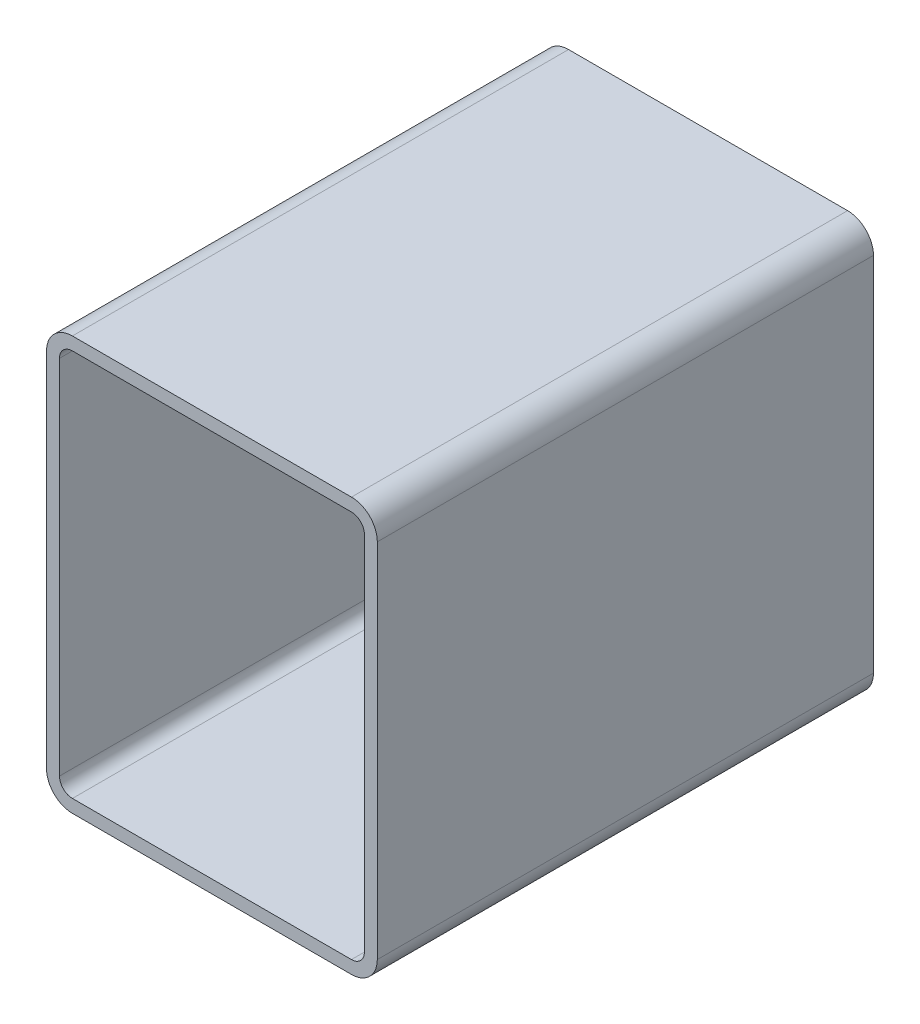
ISO-10303-21;
HEADER;
FILE_DESCRIPTION(('STEP AP214'),'2;1');
FILE_NAME('part.step','',(''),(''),'','','');
FILE_SCHEMA(('AUTOMOTIVE_DESIGN { 1 0 10303 214 1 1 1 1 }'));
ENDSEC;
DATA;
#1=APPLICATION_CONTEXT('core data for automotive mechanical design processes');
#2=APPLICATION_PROTOCOL_DEFINITION('international standard','automotive_design',2000,#1);
#3=PRODUCT_CONTEXT('',#1,'mechanical');
#4=PRODUCT('Part','Part','',(#3));
#5=PRODUCT_RELATED_PRODUCT_CATEGORY('part','',(#4));
#6=PRODUCT_DEFINITION_FORMATION('','',#4);
#7=PRODUCT_DEFINITION_CONTEXT('part definition',#1,'design');
#8=PRODUCT_DEFINITION('design','',#6,#7);
#9=PRODUCT_DEFINITION_SHAPE('','',#8);
#10=(LENGTH_UNIT() NAMED_UNIT(*) SI_UNIT(.MILLI.,.METRE.));
#11=(NAMED_UNIT(*) PLANE_ANGLE_UNIT() SI_UNIT($,.RADIAN.));
#12=(NAMED_UNIT(*) SI_UNIT($,.STERADIAN.) SOLID_ANGLE_UNIT());
#13=UNCERTAINTY_MEASURE_WITH_UNIT(LENGTH_MEASURE(1.E-05),#10,'distance_accuracy_value','');
#14=(GEOMETRIC_REPRESENTATION_CONTEXT(3) GLOBAL_UNCERTAINTY_ASSIGNED_CONTEXT((#13)) GLOBAL_UNIT_ASSIGNED_CONTEXT((#10,
#11,#12)) REPRESENTATION_CONTEXT('',''));
#15=CARTESIAN_POINT('',(0.,0.,0.));
#16=DIRECTION('',(0.,0.,1.));
#17=DIRECTION('',(1.,0.,0.));
#18=AXIS2_PLACEMENT_3D('',#15,#16,#17);
#19=CARTESIAN_POINT('',(17.2659404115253,240.045313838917,304.8));
#20=DIRECTION('',(0.,0.,1.));
#21=DIRECTION('',(1.,0.,0.));
#22=AXIS2_PLACEMENT_3D('',#19,#20,#21);
#23=PLANE('',#22);
#24=CARTESIAN_POINT('',(17.2659404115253,240.045313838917,304.8));
#25=DIRECTION('',(0.,0.,1.));
#26=DIRECTION('',(1.,0.,0.));
#27=AXIS2_PLACEMENT_3D('',#24,#25,#26);
#28=CIRCLE('',#27,15.875);
#29=CARTESIAN_POINT('',(17.2659404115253,255.920313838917,304.8));
#30=VERTEX_POINT('',#29);
#31=CARTESIAN_POINT('',(1.3909404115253,240.045313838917,304.8));
#32=VERTEX_POINT('',#31);
#33=EDGE_CURVE('E211',#30,#32,#28,.T.);
#34=ORIENTED_EDGE('',*,*,#33,.T.);
#35=DIRECTION('',(0.,-1.,0.));
#36=VECTOR('',#35,1.);
#37=CARTESIAN_POINT('',(1.3909404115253,17.7953138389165,304.8));
#38=LINE('',#37,#36);
#39=CARTESIAN_POINT('',(1.3909404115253,17.7953138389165,304.8));
#40=VERTEX_POINT('',#39);
#41=EDGE_CURVE('E214',#32,#40,#38,.T.);
#42=ORIENTED_EDGE('',*,*,#41,.T.);
#43=CARTESIAN_POINT('',(17.2659404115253,17.7953138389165,304.8));
#44=DIRECTION('',(0.,0.,1.));
#45=DIRECTION('',(1.,0.,0.));
#46=AXIS2_PLACEMENT_3D('',#43,#44,#45);
#47=CIRCLE('',#46,15.875);
#48=CARTESIAN_POINT('',(17.2659404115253,1.92031383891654,304.8));
#49=VERTEX_POINT('',#48);
#50=EDGE_CURVE('E217',#40,#49,#47,.T.);
#51=ORIENTED_EDGE('',*,*,#50,.T.);
#52=DIRECTION('',(1.,0.,0.));
#53=VECTOR('',#52,1.);
#54=CARTESIAN_POINT('',(188.715940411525,1.92031383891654,304.8));
#55=LINE('',#54,#53);
#56=CARTESIAN_POINT('',(188.715940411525,1.92031383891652,304.8));
#57=VERTEX_POINT('',#56);
#58=EDGE_CURVE('E219',#49,#57,#55,.T.);
#59=ORIENTED_EDGE('',*,*,#58,.T.);
#60=CARTESIAN_POINT('',(188.715940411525,17.7953138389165,304.8));
#61=DIRECTION('',(0.,0.,1.));
#62=DIRECTION('',(1.,0.,0.));
#63=AXIS2_PLACEMENT_3D('',#60,#61,#62);
#64=CIRCLE('',#63,15.875);
#65=CARTESIAN_POINT('',(204.590940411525,17.7953138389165,304.8));
#66=VERTEX_POINT('',#65);
#67=EDGE_CURVE('E221',#57,#66,#64,.T.);
#68=ORIENTED_EDGE('',*,*,#67,.T.);
#69=DIRECTION('',(0.,1.,0.));
#70=VECTOR('',#69,1.);
#71=CARTESIAN_POINT('',(204.590940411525,240.045313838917,304.8));
#72=LINE('',#71,#70);
#73=CARTESIAN_POINT('',(204.590940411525,240.045313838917,304.8));
#74=VERTEX_POINT('',#73);
#75=EDGE_CURVE('E223',#66,#74,#72,.T.);
#76=ORIENTED_EDGE('',*,*,#75,.T.);
#77=CARTESIAN_POINT('',(188.715940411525,240.045313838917,304.8));
#78=DIRECTION('',(0.,0.,1.));
#79=DIRECTION('',(1.,0.,0.));
#80=AXIS2_PLACEMENT_3D('',#77,#78,#79);
#81=CIRCLE('',#80,15.875);
#82=CARTESIAN_POINT('',(188.715940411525,255.920313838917,304.8));
#83=VERTEX_POINT('',#82);
#84=EDGE_CURVE('E225',#74,#83,#81,.T.);
#85=ORIENTED_EDGE('',*,*,#84,.T.);
#86=DIRECTION('',(-1.,0.,0.));
#87=VECTOR('',#86,1.);
#88=CARTESIAN_POINT('',(17.2659404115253,255.920313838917,304.8));
#89=LINE('',#88,#87);
#90=EDGE_CURVE('E227',#83,#30,#89,.T.);
#91=ORIENTED_EDGE('',*,*,#90,.T.);
#92=EDGE_LOOP('',(#34,#42,#51,#59,#68,#76,#85,#91));
#93=FACE_BOUND('',#92,.T.);
#94=DIRECTION('',(0.,-1.,0.));
#95=VECTOR('',#94,1.);
#96=CARTESIAN_POINT('',(9.3284404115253,17.7953138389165,304.8));
#97=LINE('',#96,#95);
#98=CARTESIAN_POINT('',(9.3284404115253,240.045313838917,304.8));
#99=VERTEX_POINT('',#98);
#100=CARTESIAN_POINT('',(9.3284404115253,17.7953138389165,304.8));
#101=VERTEX_POINT('',#100);
#102=EDGE_CURVE('E154',#99,#101,#97,.T.);
#103=ORIENTED_EDGE('',*,*,#102,.F.);
#104=CARTESIAN_POINT('',(17.2659404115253,240.045313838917,304.8));
#105=DIRECTION('',(0.,0.,1.));
#106=DIRECTION('',(1.,0.,0.));
#107=AXIS2_PLACEMENT_3D('',#104,#105,#106);
#108=CIRCLE('',#107,7.9375);
#109=CARTESIAN_POINT('',(17.2659404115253,247.982813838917,304.8));
#110=VERTEX_POINT('',#109);
#111=EDGE_CURVE('E146',#110,#99,#108,.T.);
#112=ORIENTED_EDGE('',*,*,#111,.F.);
#113=DIRECTION('',(-1.,0.,0.));
#114=VECTOR('',#113,1.);
#115=CARTESIAN_POINT('',(17.2659404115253,247.982813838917,304.8));
#116=LINE('',#115,#114);
#117=CARTESIAN_POINT('',(188.715940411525,247.982813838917,304.8));
#118=VERTEX_POINT('',#117);
#119=EDGE_CURVE('E179',#118,#110,#116,.T.);
#120=ORIENTED_EDGE('',*,*,#119,.F.);
#121=CARTESIAN_POINT('',(188.715940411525,240.045313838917,304.8));
#122=DIRECTION('',(0.,0.,1.));
#123=DIRECTION('',(1.,0.,0.));
#124=AXIS2_PLACEMENT_3D('',#121,#122,#123);
#125=CIRCLE('',#124,7.93750000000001);
#126=CARTESIAN_POINT('',(196.653440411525,240.045313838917,304.8));
#127=VERTEX_POINT('',#126);
#128=EDGE_CURVE('E177',#127,#118,#125,.T.);
#129=ORIENTED_EDGE('',*,*,#128,.F.);
#130=DIRECTION('',(0.,1.,0.));
#131=VECTOR('',#130,1.);
#132=CARTESIAN_POINT('',(196.653440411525,240.045313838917,304.8));
#133=LINE('',#132,#131);
#134=CARTESIAN_POINT('',(196.653440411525,17.7953138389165,304.8));
#135=VERTEX_POINT('',#134);
#136=EDGE_CURVE('E175',#135,#127,#133,.T.);
#137=ORIENTED_EDGE('',*,*,#136,.F.);
#138=CARTESIAN_POINT('',(188.715940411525,17.7953138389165,304.8));
#139=DIRECTION('',(0.,0.,1.));
#140=DIRECTION('',(1.,0.,0.));
#141=AXIS2_PLACEMENT_3D('',#138,#139,#140);
#142=CIRCLE('',#141,7.93750000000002);
#143=CARTESIAN_POINT('',(188.715940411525,9.85781383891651,304.8));
#144=VERTEX_POINT('',#143);
#145=EDGE_CURVE('E173',#144,#135,#142,.T.);
#146=ORIENTED_EDGE('',*,*,#145,.F.);
#147=DIRECTION('',(1.,0.,0.));
#148=VECTOR('',#147,1.);
#149=CARTESIAN_POINT('',(188.715940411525,9.85781383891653,304.8));
#150=LINE('',#149,#148);
#151=CARTESIAN_POINT('',(17.2659404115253,9.85781383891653,304.8));
#152=VERTEX_POINT('',#151);
#153=EDGE_CURVE('E169',#152,#144,#150,.T.);
#154=ORIENTED_EDGE('',*,*,#153,.F.);
#155=CARTESIAN_POINT('',(17.2659404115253,17.7953138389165,304.8));
#156=DIRECTION('',(0.,0.,1.));
#157=DIRECTION('',(1.,0.,0.));
#158=AXIS2_PLACEMENT_3D('',#155,#156,#157);
#159=CIRCLE('',#158,7.9375);
#160=EDGE_CURVE('E167',#101,#152,#159,.T.);
#161=ORIENTED_EDGE('',*,*,#160,.F.);
#162=EDGE_LOOP('',(#103,#112,#120,#129,#137,#146,#154,#161));
#163=FACE_BOUND('',#162,.T.);
#164=ADVANCED_FACE('F33',(#93,#163),#23,.T.);
#165=CARTESIAN_POINT('',(17.2659404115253,240.045313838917,0.));
#166=DIRECTION('',(0.,0.,1.));
#167=DIRECTION('',(1.,0.,0.));
#168=AXIS2_PLACEMENT_3D('',#165,#166,#167);
#169=PLANE('',#168);
#170=CARTESIAN_POINT('',(17.2659404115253,240.045313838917,0.));
#171=DIRECTION('',(0.,0.,1.));
#172=DIRECTION('',(1.,0.,0.));
#173=AXIS2_PLACEMENT_3D('',#170,#171,#172);
#174=CIRCLE('',#173,15.875);
#175=CARTESIAN_POINT('',(17.2659404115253,255.920313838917,0.));
#176=VERTEX_POINT('',#175);
#177=CARTESIAN_POINT('',(1.3909404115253,240.045313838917,0.));
#178=VERTEX_POINT('',#177);
#179=EDGE_CURVE('E162',#176,#178,#174,.T.);
#180=ORIENTED_EDGE('',*,*,#179,.F.);
#181=DIRECTION('',(-1.,0.,0.));
#182=VECTOR('',#181,1.);
#183=CARTESIAN_POINT('',(17.2659404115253,255.920313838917,0.));
#184=LINE('',#183,#182);
#185=CARTESIAN_POINT('',(188.715940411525,255.920313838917,0.));
#186=VERTEX_POINT('',#185);
#187=EDGE_CURVE('E215',#186,#176,#184,.T.);
#188=ORIENTED_EDGE('',*,*,#187,.F.);
#189=CARTESIAN_POINT('',(188.715940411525,240.045313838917,0.));
#190=DIRECTION('',(0.,0.,1.));
#191=DIRECTION('',(1.,0.,0.));
#192=AXIS2_PLACEMENT_3D('',#189,#190,#191);
#193=CIRCLE('',#192,15.875);
#194=CARTESIAN_POINT('',(204.590940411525,240.045313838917,0.));
#195=VERTEX_POINT('',#194);
#196=EDGE_CURVE('E242',#195,#186,#193,.T.);
#197=ORIENTED_EDGE('',*,*,#196,.F.);
#198=DIRECTION('',(0.,1.,0.));
#199=VECTOR('',#198,1.);
#200=CARTESIAN_POINT('',(204.590940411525,240.045313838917,0.));
#201=LINE('',#200,#199);
#202=CARTESIAN_POINT('',(204.590940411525,17.7953138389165,0.));
#203=VERTEX_POINT('',#202);
#204=EDGE_CURVE('E240',#203,#195,#201,.T.);
#205=ORIENTED_EDGE('',*,*,#204,.F.);
#206=CARTESIAN_POINT('',(188.715940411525,17.7953138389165,0.));
#207=DIRECTION('',(0.,0.,1.));
#208=DIRECTION('',(1.,0.,0.));
#209=AXIS2_PLACEMENT_3D('',#206,#207,#208);
#210=CIRCLE('',#209,15.875);
#211=CARTESIAN_POINT('',(188.715940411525,1.92031383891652,0.));
#212=VERTEX_POINT('',#211);
#213=EDGE_CURVE('E238',#212,#203,#210,.T.);
#214=ORIENTED_EDGE('',*,*,#213,.F.);
#215=DIRECTION('',(1.,0.,0.));
#216=VECTOR('',#215,1.);
#217=CARTESIAN_POINT('',(188.715940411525,1.92031383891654,0.));
#218=LINE('',#217,#216);
#219=CARTESIAN_POINT('',(17.2659404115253,1.92031383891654,0.));
#220=VERTEX_POINT('',#219);
#221=EDGE_CURVE('E236',#220,#212,#218,.T.);
#222=ORIENTED_EDGE('',*,*,#221,.F.);
#223=CARTESIAN_POINT('',(17.2659404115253,17.7953138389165,0.));
#224=DIRECTION('',(0.,0.,1.));
#225=DIRECTION('',(1.,0.,0.));
#226=AXIS2_PLACEMENT_3D('',#223,#224,#225);
#227=CIRCLE('',#226,15.875);
#228=CARTESIAN_POINT('',(1.3909404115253,17.7953138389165,0.));
#229=VERTEX_POINT('',#228);
#230=EDGE_CURVE('E234',#229,#220,#227,.T.);
#231=ORIENTED_EDGE('',*,*,#230,.F.);
#232=DIRECTION('',(0.,-1.,0.));
#233=VECTOR('',#232,1.);
#234=CARTESIAN_POINT('',(1.3909404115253,17.7953138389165,0.));
#235=LINE('',#234,#233);
#236=EDGE_CURVE('E232',#178,#229,#235,.T.);
#237=ORIENTED_EDGE('',*,*,#236,.F.);
#238=EDGE_LOOP('',(#180,#188,#197,#205,#214,#222,#231,#237));
#239=FACE_BOUND('',#238,.T.);
#240=CARTESIAN_POINT('',(17.2659404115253,240.045313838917,0.));
#241=DIRECTION('',(0.,0.,1.));
#242=DIRECTION('',(1.,0.,0.));
#243=AXIS2_PLACEMENT_3D('',#240,#241,#242);
#244=CIRCLE('',#243,7.9375);
#245=CARTESIAN_POINT('',(17.2659404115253,247.982813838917,0.));
#246=VERTEX_POINT('',#245);
#247=CARTESIAN_POINT('',(9.3284404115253,240.045313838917,0.));
#248=VERTEX_POINT('',#247);
#249=EDGE_CURVE('E56',#246,#248,#244,.T.);
#250=ORIENTED_EDGE('',*,*,#249,.T.);
#251=DIRECTION('',(0.,-1.,0.));
#252=VECTOR('',#251,1.);
#253=CARTESIAN_POINT('',(9.3284404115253,17.7953138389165,0.));
#254=LINE('',#253,#252);
#255=CARTESIAN_POINT('',(9.3284404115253,17.7953138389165,0.));
#256=VERTEX_POINT('',#255);
#257=EDGE_CURVE('E161',#248,#256,#254,.T.);
#258=ORIENTED_EDGE('',*,*,#257,.T.);
#259=CARTESIAN_POINT('',(17.2659404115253,17.7953138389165,0.));
#260=DIRECTION('',(0.,0.,1.));
#261=DIRECTION('',(1.,0.,0.));
#262=AXIS2_PLACEMENT_3D('',#259,#260,#261);
#263=CIRCLE('',#262,7.9375);
#264=CARTESIAN_POINT('',(17.2659404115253,9.85781383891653,0.));
#265=VERTEX_POINT('',#264);
#266=EDGE_CURVE('E183',#256,#265,#263,.T.);
#267=ORIENTED_EDGE('',*,*,#266,.T.);
#268=DIRECTION('',(1.,0.,0.));
#269=VECTOR('',#268,1.);
#270=CARTESIAN_POINT('',(188.715940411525,9.85781383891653,0.));
#271=LINE('',#270,#269);
#272=CARTESIAN_POINT('',(188.715940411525,9.85781383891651,0.));
#273=VERTEX_POINT('',#272);
#274=EDGE_CURVE('E186',#265,#273,#271,.T.);
#275=ORIENTED_EDGE('',*,*,#274,.T.);
#276=CARTESIAN_POINT('',(188.715940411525,17.7953138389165,0.));
#277=DIRECTION('',(0.,0.,1.));
#278=DIRECTION('',(1.,0.,0.));
#279=AXIS2_PLACEMENT_3D('',#276,#277,#278);
#280=CIRCLE('',#279,7.93750000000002);
#281=CARTESIAN_POINT('',(196.653440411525,17.7953138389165,0.));
#282=VERTEX_POINT('',#281);
#283=EDGE_CURVE('E189',#273,#282,#280,.T.);
#284=ORIENTED_EDGE('',*,*,#283,.T.);
#285=DIRECTION('',(0.,1.,0.));
#286=VECTOR('',#285,1.);
#287=CARTESIAN_POINT('',(196.653440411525,240.045313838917,0.));
#288=LINE('',#287,#286);
#289=CARTESIAN_POINT('',(196.653440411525,240.045313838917,0.));
#290=VERTEX_POINT('',#289);
#291=EDGE_CURVE('E192',#282,#290,#288,.T.);
#292=ORIENTED_EDGE('',*,*,#291,.T.);
#293=CARTESIAN_POINT('',(188.715940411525,240.045313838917,0.));
#294=DIRECTION('',(0.,0.,1.));
#295=DIRECTION('',(1.,0.,0.));
#296=AXIS2_PLACEMENT_3D('',#293,#294,#295);
#297=CIRCLE('',#296,7.93750000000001);
#298=CARTESIAN_POINT('',(188.715940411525,247.982813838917,0.));
#299=VERTEX_POINT('',#298);
#300=EDGE_CURVE('E195',#290,#299,#297,.T.);
#301=ORIENTED_EDGE('',*,*,#300,.T.);
#302=DIRECTION('',(-1.,0.,0.));
#303=VECTOR('',#302,1.);
#304=CARTESIAN_POINT('',(17.2659404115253,247.982813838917,0.));
#305=LINE('',#304,#303);
#306=EDGE_CURVE('E155',#299,#246,#305,.T.);
#307=ORIENTED_EDGE('',*,*,#306,.T.);
#308=EDGE_LOOP('',(#250,#258,#267,#275,#284,#292,#301,#307));
#309=FACE_BOUND('',#308,.T.);
#310=ADVANCED_FACE('F272',(#239,#309),#169,.F.);
#311=CARTESIAN_POINT('',(17.2659404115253,240.045313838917,304.8));
#312=DIRECTION('',(0.,0.,-1.));
#313=DIRECTION('',(-1.,0.,0.));
#314=AXIS2_PLACEMENT_3D('',#311,#312,#313);
#315=CYLINDRICAL_SURFACE('',#314,15.875);
#316=ORIENTED_EDGE('',*,*,#179,.T.);
#317=DIRECTION('',(0.,0.,-1.));
#318=VECTOR('',#317,1.);
#319=CARTESIAN_POINT('',(1.3909404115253,240.045313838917,304.8));
#320=LINE('',#319,#318);
#321=EDGE_CURVE('E11',#32,#178,#320,.T.);
#322=ORIENTED_EDGE('',*,*,#321,.F.);
#323=ORIENTED_EDGE('',*,*,#33,.F.);
#324=DIRECTION('',(0.,0.,-1.));
#325=VECTOR('',#324,1.);
#326=CARTESIAN_POINT('',(17.2659404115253,255.920313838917,304.8));
#327=LINE('',#326,#325);
#328=EDGE_CURVE('E229',#30,#176,#327,.T.);
#329=ORIENTED_EDGE('',*,*,#328,.T.);
#330=EDGE_LOOP('',(#316,#322,#323,#329));
#331=FACE_BOUND('',#330,.T.);
#332=ADVANCED_FACE('F35',(#331),#315,.T.);
#333=CARTESIAN_POINT('',(1.3909404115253,17.7953138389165,304.8));
#334=DIRECTION('',(1.,0.,0.));
#335=DIRECTION('',(0.,0.,-1.));
#336=AXIS2_PLACEMENT_3D('',#333,#334,#335);
#337=PLANE('',#336);
#338=ORIENTED_EDGE('',*,*,#236,.T.);
#339=DIRECTION('',(0.,0.,-1.));
#340=VECTOR('',#339,1.);
#341=CARTESIAN_POINT('',(1.3909404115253,17.7953138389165,304.8));
#342=LINE('',#341,#340);
#343=EDGE_CURVE('E41',#40,#229,#342,.T.);
#344=ORIENTED_EDGE('',*,*,#343,.F.);
#345=ORIENTED_EDGE('',*,*,#41,.F.);
#346=ORIENTED_EDGE('',*,*,#321,.T.);
#347=EDGE_LOOP('',(#338,#344,#345,#346));
#348=FACE_BOUND('',#347,.T.);
#349=ADVANCED_FACE('F289',(#348),#337,.F.);
#350=CARTESIAN_POINT('',(17.2659404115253,17.7953138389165,304.8));
#351=DIRECTION('',(0.,0.,-1.));
#352=DIRECTION('',(-1.,0.,0.));
#353=AXIS2_PLACEMENT_3D('',#350,#351,#352);
#354=CYLINDRICAL_SURFACE('',#353,15.875);
#355=ORIENTED_EDGE('',*,*,#230,.T.);
#356=DIRECTION('',(0.,0.,-1.));
#357=VECTOR('',#356,1.);
#358=CARTESIAN_POINT('',(17.2659404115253,1.92031383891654,304.8));
#359=LINE('',#358,#357);
#360=EDGE_CURVE('E259',#49,#220,#359,.T.);
#361=ORIENTED_EDGE('',*,*,#360,.F.);
#362=ORIENTED_EDGE('',*,*,#50,.F.);
#363=ORIENTED_EDGE('',*,*,#343,.T.);
#364=EDGE_LOOP('',(#355,#361,#362,#363));
#365=FACE_BOUND('',#364,.T.);
#366=ADVANCED_FACE('F266',(#365),#354,.T.);
#367=CARTESIAN_POINT('',(188.715940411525,1.92031383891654,304.8));
#368=DIRECTION('',(0.,1.,0.));
#369=DIRECTION('',(0.,0.,1.));
#370=AXIS2_PLACEMENT_3D('',#367,#368,#369);
#371=PLANE('',#370);
#372=ORIENTED_EDGE('',*,*,#221,.T.);
#373=DIRECTION('',(0.,0.,-1.));
#374=VECTOR('',#373,1.);
#375=CARTESIAN_POINT('',(188.715940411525,1.92031383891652,304.8));
#376=LINE('',#375,#374);
#377=EDGE_CURVE('E256',#57,#212,#376,.T.);
#378=ORIENTED_EDGE('',*,*,#377,.F.);
#379=ORIENTED_EDGE('',*,*,#58,.F.);
#380=ORIENTED_EDGE('',*,*,#360,.T.);
#381=EDGE_LOOP('',(#372,#378,#379,#380));
#382=FACE_BOUND('',#381,.T.);
#383=ADVANCED_FACE('F278',(#382),#371,.F.);
#384=CARTESIAN_POINT('',(188.715940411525,17.7953138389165,304.8));
#385=DIRECTION('',(0.,0.,-1.));
#386=DIRECTION('',(-1.,0.,0.));
#387=AXIS2_PLACEMENT_3D('',#384,#385,#386);
#388=CYLINDRICAL_SURFACE('',#387,15.875);
#389=ORIENTED_EDGE('',*,*,#213,.T.);
#390=DIRECTION('',(0.,0.,-1.));
#391=VECTOR('',#390,1.);
#392=CARTESIAN_POINT('',(204.590940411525,17.7953138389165,304.8));
#393=LINE('',#392,#391);
#394=EDGE_CURVE('E253',#66,#203,#393,.T.);
#395=ORIENTED_EDGE('',*,*,#394,.F.);
#396=ORIENTED_EDGE('',*,*,#67,.F.);
#397=ORIENTED_EDGE('',*,*,#377,.T.);
#398=EDGE_LOOP('',(#389,#395,#396,#397));
#399=FACE_BOUND('',#398,.T.);
#400=ADVANCED_FACE('F282',(#399),#388,.T.);
#401=CARTESIAN_POINT('',(204.590940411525,240.045313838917,304.8));
#402=DIRECTION('',(-1.,0.,0.));
#403=DIRECTION('',(0.,0.,1.));
#404=AXIS2_PLACEMENT_3D('',#401,#402,#403);
#405=PLANE('',#404);
#406=ORIENTED_EDGE('',*,*,#204,.T.);
#407=DIRECTION('',(0.,0.,-1.));
#408=VECTOR('',#407,1.);
#409=CARTESIAN_POINT('',(204.590940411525,240.045313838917,304.8));
#410=LINE('',#409,#408);
#411=EDGE_CURVE('E250',#74,#195,#410,.T.);
#412=ORIENTED_EDGE('',*,*,#411,.F.);
#413=ORIENTED_EDGE('',*,*,#75,.F.);
#414=ORIENTED_EDGE('',*,*,#394,.T.);
#415=EDGE_LOOP('',(#406,#412,#413,#414));
#416=FACE_BOUND('',#415,.T.);
#417=ADVANCED_FACE('F302',(#416),#405,.F.);
#418=CARTESIAN_POINT('',(188.715940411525,240.045313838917,304.8));
#419=DIRECTION('',(0.,0.,-1.));
#420=DIRECTION('',(-1.,0.,0.));
#421=AXIS2_PLACEMENT_3D('',#418,#419,#420);
#422=CYLINDRICAL_SURFACE('',#421,15.875);
#423=ORIENTED_EDGE('',*,*,#196,.T.);
#424=DIRECTION('',(0.,0.,-1.));
#425=VECTOR('',#424,1.);
#426=CARTESIAN_POINT('',(188.715940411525,255.920313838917,304.8));
#427=LINE('',#426,#425);
#428=EDGE_CURVE('E247',#83,#186,#427,.T.);
#429=ORIENTED_EDGE('',*,*,#428,.F.);
#430=ORIENTED_EDGE('',*,*,#84,.F.);
#431=ORIENTED_EDGE('',*,*,#411,.T.);
#432=EDGE_LOOP('',(#423,#429,#430,#431));
#433=FACE_BOUND('',#432,.T.);
#434=ADVANCED_FACE('F300',(#433),#422,.T.);
#435=CARTESIAN_POINT('',(17.2659404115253,255.920313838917,304.8));
#436=DIRECTION('',(0.,-1.,0.));
#437=DIRECTION('',(0.,0.,-1.));
#438=AXIS2_PLACEMENT_3D('',#435,#436,#437);
#439=PLANE('',#438);
#440=ORIENTED_EDGE('',*,*,#187,.T.);
#441=ORIENTED_EDGE('',*,*,#328,.F.);
#442=ORIENTED_EDGE('',*,*,#90,.F.);
#443=ORIENTED_EDGE('',*,*,#428,.T.);
#444=EDGE_LOOP('',(#440,#441,#442,#443));
#445=FACE_BOUND('',#444,.T.);
#446=ADVANCED_FACE('F295',(#445),#439,.F.);
#447=CARTESIAN_POINT('',(17.2659404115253,240.045313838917,304.8));
#448=DIRECTION('',(0.,0.,-1.));
#449=DIRECTION('',(-1.,0.,0.));
#450=AXIS2_PLACEMENT_3D('',#447,#448,#449);
#451=CYLINDRICAL_SURFACE('',#450,7.9375);
#452=ORIENTED_EDGE('',*,*,#249,.F.);
#453=DIRECTION('',(0.,0.,-1.));
#454=VECTOR('',#453,1.);
#455=CARTESIAN_POINT('',(17.2659404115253,247.982813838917,304.8));
#456=LINE('',#455,#454);
#457=EDGE_CURVE('E150',#110,#246,#456,.T.);
#458=ORIENTED_EDGE('',*,*,#457,.F.);
#459=ORIENTED_EDGE('',*,*,#111,.T.);
#460=DIRECTION('',(0.,0.,-1.));
#461=VECTOR('',#460,1.);
#462=CARTESIAN_POINT('',(9.3284404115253,240.045313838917,304.8));
#463=LINE('',#462,#461);
#464=EDGE_CURVE('E149',#99,#248,#463,.T.);
#465=ORIENTED_EDGE('',*,*,#464,.T.);
#466=EDGE_LOOP('',(#452,#458,#459,#465));
#467=FACE_BOUND('',#466,.T.);
#468=ADVANCED_FACE('F148',(#467),#451,.F.);
#469=CARTESIAN_POINT('',(9.3284404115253,17.7953138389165,304.8));
#470=DIRECTION('',(1.,0.,0.));
#471=DIRECTION('',(0.,0.,-1.));
#472=AXIS2_PLACEMENT_3D('',#469,#470,#471);
#473=PLANE('',#472);
#474=ORIENTED_EDGE('',*,*,#257,.F.);
#475=ORIENTED_EDGE('',*,*,#464,.F.);
#476=ORIENTED_EDGE('',*,*,#102,.T.);
#477=DIRECTION('',(0.,0.,-1.));
#478=VECTOR('',#477,1.);
#479=CARTESIAN_POINT('',(9.3284404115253,17.7953138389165,304.8));
#480=LINE('',#479,#478);
#481=EDGE_CURVE('E163',#101,#256,#480,.T.);
#482=ORIENTED_EDGE('',*,*,#481,.T.);
#483=EDGE_LOOP('',(#474,#475,#476,#482));
#484=FACE_BOUND('',#483,.T.);
#485=ADVANCED_FACE('F158',(#484),#473,.T.);
#486=CARTESIAN_POINT('',(17.2659404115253,17.7953138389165,304.8));
#487=DIRECTION('',(0.,0.,-1.));
#488=DIRECTION('',(-1.,0.,0.));
#489=AXIS2_PLACEMENT_3D('',#486,#487,#488);
#490=CYLINDRICAL_SURFACE('',#489,7.9375);
#491=ORIENTED_EDGE('',*,*,#266,.F.);
#492=ORIENTED_EDGE('',*,*,#481,.F.);
#493=ORIENTED_EDGE('',*,*,#160,.T.);
#494=DIRECTION('',(0.,0.,-1.));
#495=VECTOR('',#494,1.);
#496=CARTESIAN_POINT('',(17.2659404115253,9.85781383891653,304.8));
#497=LINE('',#496,#495);
#498=EDGE_CURVE('E208',#152,#265,#497,.T.);
#499=ORIENTED_EDGE('',*,*,#498,.T.);
#500=EDGE_LOOP('',(#491,#492,#493,#499));
#501=FACE_BOUND('',#500,.T.);
#502=ADVANCED_FACE('F327',(#501),#490,.F.);
#503=CARTESIAN_POINT('',(188.715940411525,9.85781383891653,304.8));
#504=DIRECTION('',(0.,1.,0.));
#505=DIRECTION('',(0.,0.,1.));
#506=AXIS2_PLACEMENT_3D('',#503,#504,#505);
#507=PLANE('',#506);
#508=ORIENTED_EDGE('',*,*,#274,.F.);
#509=ORIENTED_EDGE('',*,*,#498,.F.);
#510=ORIENTED_EDGE('',*,*,#153,.T.);
#511=DIRECTION('',(0.,0.,-1.));
#512=VECTOR('',#511,1.);
#513=CARTESIAN_POINT('',(188.715940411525,9.85781383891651,304.8));
#514=LINE('',#513,#512);
#515=EDGE_CURVE('E206',#144,#273,#514,.T.);
#516=ORIENTED_EDGE('',*,*,#515,.T.);
#517=EDGE_LOOP('',(#508,#509,#510,#516));
#518=FACE_BOUND('',#517,.T.);
#519=ADVANCED_FACE('F331',(#518),#507,.T.);
#520=CARTESIAN_POINT('',(188.715940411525,17.7953138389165,304.8));
#521=DIRECTION('',(0.,0.,-1.));
#522=DIRECTION('',(-1.,0.,0.));
#523=AXIS2_PLACEMENT_3D('',#520,#521,#522);
#524=CYLINDRICAL_SURFACE('',#523,7.93750000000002);
#525=ORIENTED_EDGE('',*,*,#283,.F.);
#526=ORIENTED_EDGE('',*,*,#515,.F.);
#527=ORIENTED_EDGE('',*,*,#145,.T.);
#528=DIRECTION('',(0.,0.,-1.));
#529=VECTOR('',#528,1.);
#530=CARTESIAN_POINT('',(196.653440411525,17.7953138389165,304.8));
#531=LINE('',#530,#529);
#532=EDGE_CURVE('E204',#135,#282,#531,.T.);
#533=ORIENTED_EDGE('',*,*,#532,.T.);
#534=EDGE_LOOP('',(#525,#526,#527,#533));
#535=FACE_BOUND('',#534,.T.);
#536=ADVANCED_FACE('F337',(#535),#524,.F.);
#537=CARTESIAN_POINT('',(196.653440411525,240.045313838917,304.8));
#538=DIRECTION('',(-1.,0.,0.));
#539=DIRECTION('',(0.,0.,1.));
#540=AXIS2_PLACEMENT_3D('',#537,#538,#539);
#541=PLANE('',#540);
#542=ORIENTED_EDGE('',*,*,#291,.F.);
#543=ORIENTED_EDGE('',*,*,#532,.F.);
#544=ORIENTED_EDGE('',*,*,#136,.T.);
#545=DIRECTION('',(0.,0.,-1.));
#546=VECTOR('',#545,1.);
#547=CARTESIAN_POINT('',(196.653440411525,240.045313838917,304.8));
#548=LINE('',#547,#546);
#549=EDGE_CURVE('E202',#127,#290,#548,.T.);
#550=ORIENTED_EDGE('',*,*,#549,.T.);
#551=EDGE_LOOP('',(#542,#543,#544,#550));
#552=FACE_BOUND('',#551,.T.);
#553=ADVANCED_FACE('F341',(#552),#541,.T.);
#554=CARTESIAN_POINT('',(188.715940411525,240.045313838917,304.8));
#555=DIRECTION('',(0.,0.,-1.));
#556=DIRECTION('',(-1.,0.,0.));
#557=AXIS2_PLACEMENT_3D('',#554,#555,#556);
#558=CYLINDRICAL_SURFACE('',#557,7.93750000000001);
#559=ORIENTED_EDGE('',*,*,#300,.F.);
#560=ORIENTED_EDGE('',*,*,#549,.F.);
#561=ORIENTED_EDGE('',*,*,#128,.T.);
#562=DIRECTION('',(0.,0.,-1.));
#563=VECTOR('',#562,1.);
#564=CARTESIAN_POINT('',(188.715940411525,247.982813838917,304.8));
#565=LINE('',#564,#563);
#566=EDGE_CURVE('E48',#118,#299,#565,.T.);
#567=ORIENTED_EDGE('',*,*,#566,.T.);
#568=EDGE_LOOP('',(#559,#560,#561,#567));
#569=FACE_BOUND('',#568,.T.);
#570=ADVANCED_FACE('F345',(#569),#558,.F.);
#571=CARTESIAN_POINT('',(17.2659404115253,247.982813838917,304.8));
#572=DIRECTION('',(0.,-1.,0.));
#573=DIRECTION('',(0.,0.,-1.));
#574=AXIS2_PLACEMENT_3D('',#571,#572,#573);
#575=PLANE('',#574);
#576=ORIENTED_EDGE('',*,*,#306,.F.);
#577=ORIENTED_EDGE('',*,*,#566,.F.);
#578=ORIENTED_EDGE('',*,*,#119,.T.);
#579=ORIENTED_EDGE('',*,*,#457,.T.);
#580=EDGE_LOOP('',(#576,#577,#578,#579));
#581=FACE_BOUND('',#580,.T.);
#582=ADVANCED_FACE('F349',(#581),#575,.T.);
#583=CLOSED_SHELL('',(#164,#310,#332,#349,#366,#383,#400,#417,#434,#446,#468,#485,#502,#519,
#536,#553,#570,#582));
#584=MANIFOLD_SOLID_BREP('B2',#583);
#585=ADVANCED_BREP_SHAPE_REPRESENTATION('',(#18,#584),#14);
#586=SHAPE_DEFINITION_REPRESENTATION(#9,#585);
ENDSEC;
END-ISO-10303-21;
